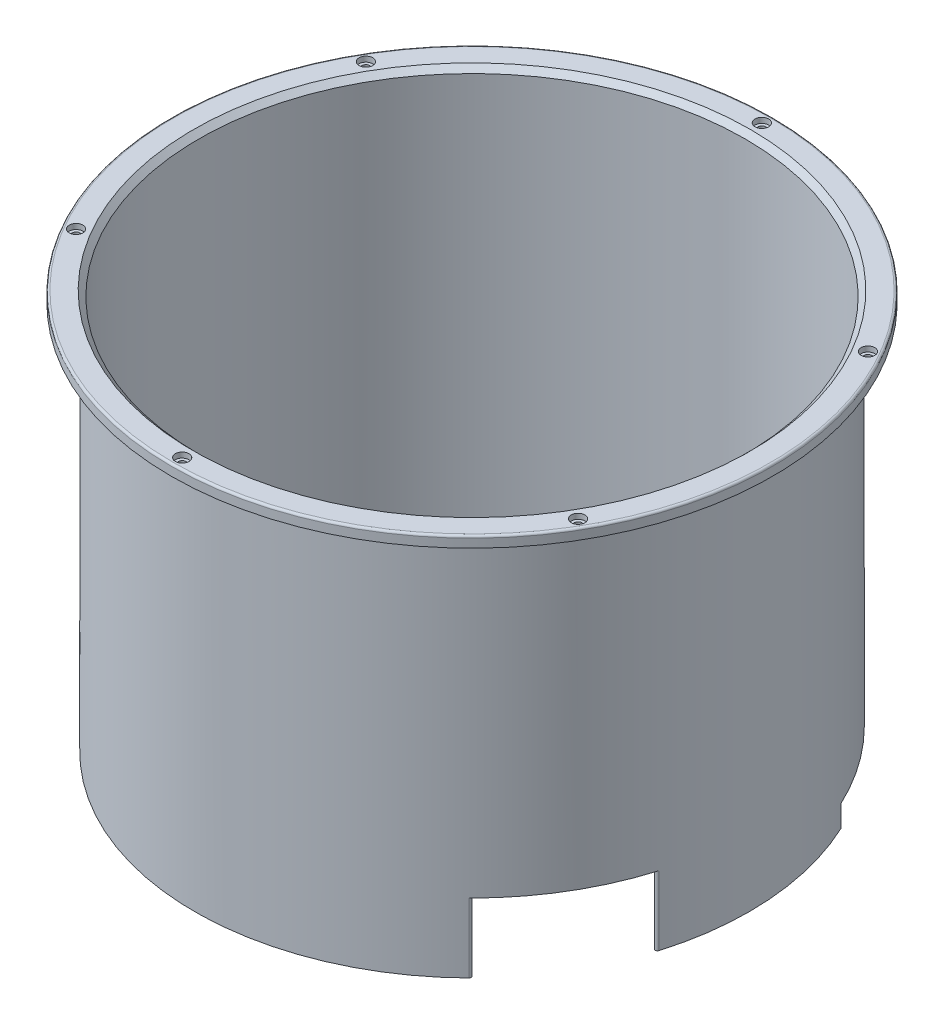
ISO-10303-21;
HEADER;
FILE_DESCRIPTION(('STEP AP214'),'2;1');
FILE_NAME('part.step','',(''),(''),'','','');
FILE_SCHEMA(('AUTOMOTIVE_DESIGN { 1 0 10303 214 1 1 1 1 }'));
ENDSEC;
DATA;
#1=APPLICATION_CONTEXT('core data for automotive mechanical design processes');
#2=APPLICATION_PROTOCOL_DEFINITION('international standard','automotive_design',2000,#1);
#3=PRODUCT_CONTEXT('',#1,'mechanical');
#4=PRODUCT('Part','Part','',(#3));
#5=PRODUCT_RELATED_PRODUCT_CATEGORY('part','',(#4));
#6=PRODUCT_DEFINITION_FORMATION('','',#4);
#7=PRODUCT_DEFINITION_CONTEXT('part definition',#1,'design');
#8=PRODUCT_DEFINITION('design','',#6,#7);
#9=PRODUCT_DEFINITION_SHAPE('','',#8);
#10=(LENGTH_UNIT() NAMED_UNIT(*) SI_UNIT(.MILLI.,.METRE.));
#11=(NAMED_UNIT(*) PLANE_ANGLE_UNIT() SI_UNIT($,.RADIAN.));
#12=(NAMED_UNIT(*) SI_UNIT($,.STERADIAN.) SOLID_ANGLE_UNIT());
#13=UNCERTAINTY_MEASURE_WITH_UNIT(LENGTH_MEASURE(1.E-05),#10,'distance_accuracy_value','');
#14=(GEOMETRIC_REPRESENTATION_CONTEXT(3) GLOBAL_UNCERTAINTY_ASSIGNED_CONTEXT((#13)) GLOBAL_UNIT_ASSIGNED_CONTEXT((#10,
#11,#12)) REPRESENTATION_CONTEXT('',''));
#15=CARTESIAN_POINT('',(0.,0.,0.));
#16=DIRECTION('',(0.,0.,1.));
#17=DIRECTION('',(1.,0.,0.));
#18=AXIS2_PLACEMENT_3D('',#15,#16,#17);
#19=CARTESIAN_POINT('',(156.129948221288,89.4079999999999,46.3952505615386));
#20=CARTESIAN_POINT('',(156.129948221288,86.6986666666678,46.3952505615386));
#21=CARTESIAN_POINT('',(156.129948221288,83.9893333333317,46.3952505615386));
#22=CARTESIAN_POINT('',(156.129948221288,67.7333333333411,46.3952505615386));
#23=CARTESIAN_POINT('',(156.129948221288,54.1866666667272,46.3952505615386));
#24=CARTESIAN_POINT('',(156.129948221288,27.0933333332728,46.3952505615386));
#25=CARTESIAN_POINT('',(156.129948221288,13.5466666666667,46.3952505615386));
#26=CARTESIAN_POINT('',(156.129948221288,-2.70933333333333,46.3952505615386));
#27=CARTESIAN_POINT('',(156.129948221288,-5.41866666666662,46.3952505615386));
#28=CARTESIAN_POINT('',(156.129948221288,-8.12799999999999,46.3952505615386));
#29=CARTESIAN_POINT('',(155.88877732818,89.4079999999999,47.2068422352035));
#30=CARTESIAN_POINT('',(155.88877732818,86.6986666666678,47.2068422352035));
#31=CARTESIAN_POINT('',(155.88877732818,83.9893333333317,47.2068422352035));
#32=CARTESIAN_POINT('',(155.88877732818,67.7333333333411,47.2068422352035));
#33=CARTESIAN_POINT('',(155.88877732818,54.1866666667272,47.2068422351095));
#34=CARTESIAN_POINT('',(155.88877732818,27.0933333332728,47.2068422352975));
#35=CARTESIAN_POINT('',(155.88877732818,13.5466666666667,47.2068422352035));
#36=CARTESIAN_POINT('',(155.88877732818,-2.70933333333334,47.2068422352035));
#37=CARTESIAN_POINT('',(155.88877732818,-5.41866666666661,47.2068422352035));
#38=CARTESIAN_POINT('',(155.88877732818,-8.12799999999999,47.2068422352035));
#39=CARTESIAN_POINT('',(154.978619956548,89.4079999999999,48.0404536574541));
#40=CARTESIAN_POINT('',(154.978619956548,86.6986666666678,48.0404536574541));
#41=CARTESIAN_POINT('',(154.978619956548,83.9893333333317,48.0404536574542));
#42=CARTESIAN_POINT('',(154.978619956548,67.7333333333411,48.0404536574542));
#43=CARTESIAN_POINT('',(154.978619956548,54.1866666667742,48.0404536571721));
#44=CARTESIAN_POINT('',(154.978619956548,27.0933333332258,48.0404536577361));
#45=CARTESIAN_POINT('',(154.978619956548,13.5466666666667,48.0404536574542));
#46=CARTESIAN_POINT('',(154.978619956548,-2.70933333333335,48.0404536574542));
#47=CARTESIAN_POINT('',(154.978619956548,-5.4186666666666,48.0404536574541));
#48=CARTESIAN_POINT('',(154.978619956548,-8.12799999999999,48.0404536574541));
#49=CARTESIAN_POINT('',(153.76123244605,89.4079999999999,47.678697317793));
#50=CARTESIAN_POINT('',(153.76123244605,86.6986666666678,47.678697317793));
#51=CARTESIAN_POINT('',(153.76123244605,83.9893333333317,47.678697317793));
#52=CARTESIAN_POINT('',(153.76123244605,67.7333333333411,47.678697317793));
#53=CARTESIAN_POINT('',(153.761232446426,54.1866666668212,47.678697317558));
#54=CARTESIAN_POINT('',(153.761232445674,27.0933333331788,47.678697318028));
#55=CARTESIAN_POINT('',(153.76123244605,13.5466666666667,47.678697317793));
#56=CARTESIAN_POINT('',(153.76123244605,-2.70933333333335,47.678697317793));
#57=CARTESIAN_POINT('',(153.76123244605,-5.4186666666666,47.678697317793));
#58=CARTESIAN_POINT('',(153.76123244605,-8.12799999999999,47.678697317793));
#59=CARTESIAN_POINT('',(153.454002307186,89.4079999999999,46.4833295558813));
#60=CARTESIAN_POINT('',(153.454002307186,86.6986666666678,46.4833295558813));
#61=CARTESIAN_POINT('',(153.454002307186,83.9893333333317,46.4833295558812));
#62=CARTESIAN_POINT('',(153.454002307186,67.7333333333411,46.4833295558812));
#63=CARTESIAN_POINT('',(153.454002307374,54.1866666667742,46.4833295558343));
#64=CARTESIAN_POINT('',(153.454002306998,27.0933333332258,46.4833295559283));
#65=CARTESIAN_POINT('',(153.454002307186,13.5466666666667,46.4833295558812));
#66=CARTESIAN_POINT('',(153.454002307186,-2.70933333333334,46.4833295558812));
#67=CARTESIAN_POINT('',(153.454002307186,-5.41866666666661,46.4833295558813));
#68=CARTESIAN_POINT('',(153.454002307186,-8.12799999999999,46.4833295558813));
#69=CARTESIAN_POINT('',(153.695173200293,89.4079999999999,45.6717378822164));
#70=CARTESIAN_POINT('',(153.695173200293,86.6986666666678,45.6717378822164));
#71=CARTESIAN_POINT('',(153.695173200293,83.9893333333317,45.6717378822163));
#72=CARTESIAN_POINT('',(153.695173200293,67.7333333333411,45.6717378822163));
#73=CARTESIAN_POINT('',(153.695173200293,54.1866666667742,45.6717378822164));
#74=CARTESIAN_POINT('',(153.695173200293,27.0933333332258,45.6717378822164));
#75=CARTESIAN_POINT('',(153.695173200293,13.5466666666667,45.6717378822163));
#76=CARTESIAN_POINT('',(153.695173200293,-2.70933333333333,45.6717378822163));
#77=CARTESIAN_POINT('',(153.695173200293,-5.41866666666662,45.6717378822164));
#78=CARTESIAN_POINT('',(153.695173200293,-8.12799999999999,45.6717378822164));
#79=(BOUNDED_SURFACE() B_SPLINE_SURFACE(5,3,((#19,#20,#21,#22,#23,#24,#25,#26,#27,#28),(#29,#30,
#31,#32,#33,#34,#35,#36,#37,#38),(#39,#40,#41,#42,#43,#44,#45,#46,#47,#48),(#49,#50,#51,#52,#53,
#54,#55,#56,#57,#58),(#59,#60,#61,#62,#63,#64,#65,#66,#67,#68),(#69,#70,#71,#72,#73,#74,#75,#76,
#77,#78)),.UNSPECIFIED.,.F.,.F.,.F.) B_SPLINE_SURFACE_WITH_KNOTS((6,6),(4,2,2,2,4),(0.,1.),
(-1.2,-1.,0.,1.,1.2),
.UNSPECIFIED.) GEOMETRIC_REPRESENTATION_ITEM() RATIONAL_B_SPLINE_SURFACE(((1.,1.,1.,1.,1.,1.,1.,
1.,1.,1.),(0.600000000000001,0.600000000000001,0.599999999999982,0.599999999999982,
0.599999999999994,0.599999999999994,0.599999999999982,0.599999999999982,0.600000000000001,
0.600000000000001),(0.400000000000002,0.400000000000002,0.399999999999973,0.399999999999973,
0.399999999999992,0.399999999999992,0.399999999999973,0.399999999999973,0.400000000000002,
0.400000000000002),(0.400000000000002,0.400000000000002,0.399999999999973,0.399999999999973,
0.399999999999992,0.399999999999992,0.399999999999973,0.399999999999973,0.400000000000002,
0.400000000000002),(0.600000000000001,0.600000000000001,0.599999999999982,0.599999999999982,
0.599999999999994,0.599999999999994,0.599999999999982,0.599999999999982,0.600000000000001,
0.600000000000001),(1.,1.,1.,1.,1.,1.,1.,1.,1.,1.))) REPRESENTATION_ITEM('') SURFACE());
#80=CARTESIAN_POINT('',(156.129948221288,-8.12799999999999,46.3952505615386));
#81=CARTESIAN_POINT('',(156.129948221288,-5.41866666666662,46.3952505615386));
#82=CARTESIAN_POINT('',(156.129948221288,-2.70933333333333,46.3952505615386));
#83=CARTESIAN_POINT('',(156.129948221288,13.5466666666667,46.3952505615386));
#84=CARTESIAN_POINT('',(156.129948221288,27.0933333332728,46.3952505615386));
#85=CARTESIAN_POINT('',(156.129948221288,54.1866666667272,46.3952505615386));
#86=CARTESIAN_POINT('',(156.129948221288,67.7333333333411,46.3952505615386));
#87=CARTESIAN_POINT('',(156.129948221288,83.9893333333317,46.3952505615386));
#88=CARTESIAN_POINT('',(156.129948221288,86.6986666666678,46.3952505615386));
#89=CARTESIAN_POINT('',(156.129948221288,89.4079999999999,46.3952505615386));
#90=(BOUNDED_CURVE() B_SPLINE_CURVE(3,(#80,#81,#82,#83,#84,#85,#86,#87,#88,#89),.UNSPECIFIED.,
.F.,.F.) B_SPLINE_CURVE_WITH_KNOTS((4,2,2,2,4),(-1.2,-1.,0.,1.,1.2),
.UNSPECIFIED.) CURVE() GEOMETRIC_REPRESENTATION_ITEM() RATIONAL_B_SPLINE_CURVE((1.,1.,1.,1.,1.,
1.,1.,1.,1.,1.)) REPRESENTATION_ITEM(''));
#91=CARTESIAN_POINT('',(156.129948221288,40.64,46.3952505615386));
#92=VERTEX_POINT('',#91);
#93=CARTESIAN_POINT('',(156.129948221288,0.,46.3952505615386));
#94=VERTEX_POINT('',#93);
#95=EDGE_CURVE('E139',#92,#94,#90,.F.);
#96=CARTESIAN_POINT('',(156.129948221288,40.64,46.3952505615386));
#97=CARTESIAN_POINT('',(155.888777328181,40.64,47.2068422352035));
#98=CARTESIAN_POINT('',(154.978619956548,40.64,48.0404536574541));
#99=CARTESIAN_POINT('',(153.76123244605,40.64,47.678697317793));
#100=CARTESIAN_POINT('',(153.454002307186,40.64,46.4833295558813));
#101=CARTESIAN_POINT('',(153.695173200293,40.64,45.6717378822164));
#102=(BOUNDED_CURVE() B_SPLINE_CURVE(5,(#96,#97,#98,#99,#100,#101),.UNSPECIFIED.,.F.,
.F.) B_SPLINE_CURVE_WITH_KNOTS((6,6),(0.,1.),
.UNSPECIFIED.) CURVE() GEOMETRIC_REPRESENTATION_ITEM() RATIONAL_B_SPLINE_CURVE((1.,
0.599999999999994,0.399999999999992,0.399999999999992,0.599999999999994,1.)) REPRESENTATION_ITEM(''));
#103=CARTESIAN_POINT('',(153.695173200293,40.64,45.6717378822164));
#104=VERTEX_POINT('',#103);
#105=EDGE_CURVE('E11',#104,#92,#102,.F.);
#106=CARTESIAN_POINT('',(153.695173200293,89.4079999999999,45.6717378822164));
#107=CARTESIAN_POINT('',(153.695173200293,86.6986666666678,45.6717378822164));
#108=CARTESIAN_POINT('',(153.695173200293,83.9893333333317,45.6717378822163));
#109=CARTESIAN_POINT('',(153.695173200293,67.7333333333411,45.6717378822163));
#110=CARTESIAN_POINT('',(153.695173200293,54.1866666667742,45.6717378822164));
#111=CARTESIAN_POINT('',(153.695173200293,27.0933333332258,45.6717378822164));
#112=CARTESIAN_POINT('',(153.695173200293,13.5466666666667,45.6717378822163));
#113=CARTESIAN_POINT('',(153.695173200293,-2.70933333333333,45.6717378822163));
#114=CARTESIAN_POINT('',(153.695173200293,-5.41866666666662,45.6717378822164));
#115=CARTESIAN_POINT('',(153.695173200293,-8.12799999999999,45.6717378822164));
#116=(BOUNDED_CURVE() B_SPLINE_CURVE(3,(#106,#107,#108,#109,#110,#111,#112,#113,#114,#115),
.UNSPECIFIED.,.F.,.F.) B_SPLINE_CURVE_WITH_KNOTS((4,2,2,2,4),(-1.2,-1.,0.,1.,1.2),
.UNSPECIFIED.) CURVE() GEOMETRIC_REPRESENTATION_ITEM() RATIONAL_B_SPLINE_CURVE((1.,1.,1.,1.,1.,
1.,1.,1.,1.,1.)) REPRESENTATION_ITEM(''));
#117=CARTESIAN_POINT('',(153.695173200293,0.,45.6717378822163));
#118=VERTEX_POINT('',#117);
#119=EDGE_CURVE('E274',#118,#104,#116,.F.);
#120=CARTESIAN_POINT('',(153.695173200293,0.,45.6717378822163));
#121=CARTESIAN_POINT('',(153.454002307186,0.,46.4833295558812));
#122=CARTESIAN_POINT('',(153.76123244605,0.,47.678697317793));
#123=CARTESIAN_POINT('',(154.978619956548,0.,48.0404536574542));
#124=CARTESIAN_POINT('',(155.88877732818,0.,47.2068422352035));
#125=CARTESIAN_POINT('',(156.129948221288,0.,46.3952505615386));
#126=(BOUNDED_CURVE() B_SPLINE_CURVE(5,(#120,#121,#122,#123,#124,#125),.UNSPECIFIED.,.F.,
.F.) B_SPLINE_CURVE_WITH_KNOTS((6,6),(0.,1.),
.UNSPECIFIED.) CURVE() GEOMETRIC_REPRESENTATION_ITEM() RATIONAL_B_SPLINE_CURVE((1.,
0.599999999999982,0.399999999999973,0.399999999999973,0.599999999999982,1.)) REPRESENTATION_ITEM(''));
#127=EDGE_CURVE('E61',#94,#118,#126,.F.);
#128=ORIENTED_EDGE('',*,*,#95,.F.);
#129=ORIENTED_EDGE('',*,*,#105,.F.);
#130=ORIENTED_EDGE('',*,*,#119,.F.);
#131=ORIENTED_EDGE('',*,*,#127,.F.);
#132=EDGE_LOOP('',(#128,#129,#130,#131));
#133=FACE_BOUND('',#132,.T.);
#134=ADVANCED_FACE('F47',(#133),#79,.T.);
#135=CARTESIAN_POINT('',(112.481264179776,89.4079999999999,114.263201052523));
#136=CARTESIAN_POINT('',(112.481264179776,86.6986666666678,114.263201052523));
#137=CARTESIAN_POINT('',(112.481264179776,83.9893333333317,114.263201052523));
#138=CARTESIAN_POINT('',(112.481264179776,67.7333333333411,114.263201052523));
#139=CARTESIAN_POINT('',(112.481264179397,54.1866666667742,114.263201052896));
#140=CARTESIAN_POINT('',(112.481264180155,27.0933333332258,114.26320105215));
#141=CARTESIAN_POINT('',(112.481264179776,13.5466666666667,114.263201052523));
#142=CARTESIAN_POINT('',(112.481264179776,-2.70933333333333,114.263201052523));
#143=CARTESIAN_POINT('',(112.481264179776,-5.41866666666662,114.263201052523));
#144=CARTESIAN_POINT('',(112.481264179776,-8.12799999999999,114.263201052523));
#145=CARTESIAN_POINT('',(113.084634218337,89.4079999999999,113.669240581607));
#146=CARTESIAN_POINT('',(113.084634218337,86.6986666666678,113.669240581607));
#147=CARTESIAN_POINT('',(113.084634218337,83.9893333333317,113.669240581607));
#148=CARTESIAN_POINT('',(113.084634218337,67.7333333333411,113.669240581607));
#149=CARTESIAN_POINT('',(113.084634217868,54.1866666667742,113.669240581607));
#150=CARTESIAN_POINT('',(113.084634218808,27.0933333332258,113.669240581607));
#151=CARTESIAN_POINT('',(113.084634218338,13.5466666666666,113.669240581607));
#152=CARTESIAN_POINT('',(113.084634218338,-2.70933333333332,113.669240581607));
#153=CARTESIAN_POINT('',(113.084634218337,-5.41866666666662,113.669240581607));
#154=CARTESIAN_POINT('',(113.084634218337,-8.12799999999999,113.669240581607));
#155=CARTESIAN_POINT('',(114.284317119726,89.4079999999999,113.379317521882));
#156=CARTESIAN_POINT('',(114.284317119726,86.6986666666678,113.379317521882));
#157=CARTESIAN_POINT('',(114.284317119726,83.9893333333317,113.379317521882));
#158=CARTESIAN_POINT('',(114.284317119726,67.7333333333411,113.379317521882));
#159=CARTESIAN_POINT('',(114.28431711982,54.1866666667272,113.379317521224));
#160=CARTESIAN_POINT('',(114.284317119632,27.0933333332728,113.37931752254));
#161=CARTESIAN_POINT('',(114.284317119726,13.5466666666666,113.379317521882));
#162=CARTESIAN_POINT('',(114.284317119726,-2.70933333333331,113.379317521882));
#163=CARTESIAN_POINT('',(114.284317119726,-5.41866666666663,113.379317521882));
#164=CARTESIAN_POINT('',(114.284317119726,-8.12799999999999,113.379317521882));
#165=CARTESIAN_POINT('',(115.175257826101,89.4079999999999,114.284372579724));
#166=CARTESIAN_POINT('',(115.175257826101,86.6986666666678,114.284372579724));
#167=CARTESIAN_POINT('',(115.175257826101,83.9893333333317,114.284372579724));
#168=CARTESIAN_POINT('',(115.175257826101,67.7333333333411,114.284372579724));
#169=CARTESIAN_POINT('',(115.175257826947,54.1866666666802,114.284372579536));
#170=CARTESIAN_POINT('',(115.175257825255,27.0933333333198,114.284372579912));
#171=CARTESIAN_POINT('',(115.175257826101,13.5466666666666,114.284372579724));
#172=CARTESIAN_POINT('',(115.175257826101,-2.70933333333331,114.284372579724));
#173=CARTESIAN_POINT('',(115.175257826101,-5.41866666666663,114.284372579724));
#174=CARTESIAN_POINT('',(115.175257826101,-8.12799999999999,114.284372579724));
#175=CARTESIAN_POINT('',(114.866515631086,89.4079999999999,115.479350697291));
#176=CARTESIAN_POINT('',(114.866515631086,86.6986666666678,115.479350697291));
#177=CARTESIAN_POINT('',(114.866515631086,83.9893333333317,115.479350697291));
#178=CARTESIAN_POINT('',(114.866515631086,67.7333333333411,115.479350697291));
#179=CARTESIAN_POINT('',(114.866515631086,54.1866666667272,115.479350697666));
#180=CARTESIAN_POINT('',(114.866515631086,27.0933333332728,115.479350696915));
#181=CARTESIAN_POINT('',(114.866515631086,13.5466666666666,115.479350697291));
#182=CARTESIAN_POINT('',(114.866515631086,-2.70933333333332,115.479350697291));
#183=CARTESIAN_POINT('',(114.866515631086,-5.41866666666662,115.479350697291));
#184=CARTESIAN_POINT('',(114.866515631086,-8.12799999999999,115.479350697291));
#185=CARTESIAN_POINT('',(114.263145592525,89.4079999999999,116.073311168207));
#186=CARTESIAN_POINT('',(114.263145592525,86.6986666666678,116.073311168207));
#187=CARTESIAN_POINT('',(114.263145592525,83.9893333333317,116.073311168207));
#188=CARTESIAN_POINT('',(114.263145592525,67.7333333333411,116.073311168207));
#189=CARTESIAN_POINT('',(114.263145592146,54.1866666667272,116.07331116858));
#190=CARTESIAN_POINT('',(114.263145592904,27.0933333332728,116.073311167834));
#191=CARTESIAN_POINT('',(114.263145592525,13.5466666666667,116.073311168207));
#192=CARTESIAN_POINT('',(114.263145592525,-2.70933333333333,116.073311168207));
#193=CARTESIAN_POINT('',(114.263145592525,-5.41866666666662,116.073311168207));
#194=CARTESIAN_POINT('',(114.263145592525,-8.12799999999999,116.073311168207));
#195=(BOUNDED_SURFACE() B_SPLINE_SURFACE(5,3,((#135,#136,#137,#138,#139,#140,#141,#142,#143,
#144),(#145,#146,#147,#148,#149,#150,#151,#152,#153,#154),(#155,#156,#157,#158,#159,#160,#161,
#162,#163,#164),(#165,#166,#167,#168,#169,#170,#171,#172,#173,#174),(#175,#176,#177,#178,#179,
#180,#181,#182,#183,#184),(#185,#186,#187,#188,#189,#190,#191,#192,#193,#194)),.UNSPECIFIED.,
.F.,.F.,.F.) B_SPLINE_SURFACE_WITH_KNOTS((6,6),(4,2,2,2,4),(0.,1.),(-1.2,-1.,0.,1.,1.2),
.UNSPECIFIED.) GEOMETRIC_REPRESENTATION_ITEM() RATIONAL_B_SPLINE_SURFACE(((1.,1.,1.,1.,1.,1.,1.,
1.,1.,1.),(0.59999999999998,0.59999999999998,0.59999999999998,0.59999999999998,
0.600000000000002,0.600000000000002,0.599999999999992,0.599999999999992,0.59999999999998,
0.59999999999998),(0.39999999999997,0.39999999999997,0.39999999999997,0.39999999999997,
0.400000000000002,0.400000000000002,0.399999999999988,0.399999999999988,0.39999999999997,
0.39999999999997),(0.39999999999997,0.39999999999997,0.39999999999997,0.39999999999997,
0.400000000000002,0.400000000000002,0.399999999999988,0.399999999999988,0.39999999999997,
0.39999999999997),(0.59999999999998,0.59999999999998,0.59999999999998,0.59999999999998,
0.600000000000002,0.600000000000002,0.599999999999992,0.599999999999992,0.59999999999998,
0.59999999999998),(1.,1.,1.,1.,1.,1.,1.,1.,1.,1.))) REPRESENTATION_ITEM('') SURFACE());
#196=CARTESIAN_POINT('',(114.263145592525,89.4079999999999,116.073311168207));
#197=CARTESIAN_POINT('',(114.263145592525,86.6986666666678,116.073311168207));
#198=CARTESIAN_POINT('',(114.263145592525,83.9893333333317,116.073311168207));
#199=CARTESIAN_POINT('',(114.263145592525,67.7333333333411,116.073311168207));
#200=CARTESIAN_POINT('',(114.263145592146,54.1866666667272,116.07331116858));
#201=CARTESIAN_POINT('',(114.263145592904,27.0933333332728,116.073311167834));
#202=CARTESIAN_POINT('',(114.263145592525,13.5466666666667,116.073311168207));
#203=CARTESIAN_POINT('',(114.263145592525,-2.70933333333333,116.073311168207));
#204=CARTESIAN_POINT('',(114.263145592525,-5.41866666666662,116.073311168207));
#205=CARTESIAN_POINT('',(114.263145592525,-8.12799999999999,116.073311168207));
#206=(BOUNDED_CURVE() B_SPLINE_CURVE(3,(#196,#197,#198,#199,#200,#201,#202,#203,#204,#205),
.UNSPECIFIED.,.F.,.F.) B_SPLINE_CURVE_WITH_KNOTS((4,2,2,2,4),(-1.2,-1.,0.,1.,1.2),
.UNSPECIFIED.) CURVE() GEOMETRIC_REPRESENTATION_ITEM() RATIONAL_B_SPLINE_CURVE((1.,1.,1.,1.,1.,
1.,1.,1.,1.,1.)) REPRESENTATION_ITEM(''));
#207=CARTESIAN_POINT('',(114.263145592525,0.,116.073311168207));
#208=VERTEX_POINT('',#207);
#209=CARTESIAN_POINT('',(114.263145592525,40.64,116.073311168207));
#210=VERTEX_POINT('',#209);
#211=EDGE_CURVE('E173',#208,#210,#206,.F.);
#212=CARTESIAN_POINT('',(114.263145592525,0.,116.073311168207));
#213=CARTESIAN_POINT('',(114.866515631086,0.,115.479350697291));
#214=CARTESIAN_POINT('',(115.175257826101,0.,114.284372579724));
#215=CARTESIAN_POINT('',(114.284317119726,0.,113.379317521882));
#216=CARTESIAN_POINT('',(113.084634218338,0.,113.669240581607));
#217=CARTESIAN_POINT('',(112.481264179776,0.,114.263201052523));
#218=(BOUNDED_CURVE() B_SPLINE_CURVE(5,(#212,#213,#214,#215,#216,#217),.UNSPECIFIED.,.F.,
.F.) B_SPLINE_CURVE_WITH_KNOTS((6,6),(0.,1.),
.UNSPECIFIED.) CURVE() GEOMETRIC_REPRESENTATION_ITEM() RATIONAL_B_SPLINE_CURVE((1.,
0.599999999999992,0.399999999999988,0.399999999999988,0.599999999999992,1.)) REPRESENTATION_ITEM(''));
#219=CARTESIAN_POINT('',(112.481264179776,0.,114.263201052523));
#220=VERTEX_POINT('',#219);
#221=EDGE_CURVE('E360',#220,#208,#218,.F.);
#222=CARTESIAN_POINT('',(112.481264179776,-8.12799999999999,114.263201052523));
#223=CARTESIAN_POINT('',(112.481264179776,-5.41866666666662,114.263201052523));
#224=CARTESIAN_POINT('',(112.481264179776,-2.70933333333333,114.263201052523));
#225=CARTESIAN_POINT('',(112.481264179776,13.5466666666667,114.263201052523));
#226=CARTESIAN_POINT('',(112.481264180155,27.0933333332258,114.26320105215));
#227=CARTESIAN_POINT('',(112.481264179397,54.1866666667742,114.263201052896));
#228=CARTESIAN_POINT('',(112.481264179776,67.7333333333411,114.263201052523));
#229=CARTESIAN_POINT('',(112.481264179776,83.9893333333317,114.263201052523));
#230=CARTESIAN_POINT('',(112.481264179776,86.6986666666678,114.263201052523));
#231=CARTESIAN_POINT('',(112.481264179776,89.4079999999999,114.263201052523));
#232=(BOUNDED_CURVE() B_SPLINE_CURVE(3,(#222,#223,#224,#225,#226,#227,#228,#229,#230,#231),
.UNSPECIFIED.,.F.,.F.) B_SPLINE_CURVE_WITH_KNOTS((4,2,2,2,4),(-1.2,-1.,0.,1.,1.2),
.UNSPECIFIED.) CURVE() GEOMETRIC_REPRESENTATION_ITEM() RATIONAL_B_SPLINE_CURVE((1.,1.,1.,1.,1.,
1.,1.,1.,1.,1.)) REPRESENTATION_ITEM(''));
#233=CARTESIAN_POINT('',(112.481264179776,40.64,114.263201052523));
#234=VERTEX_POINT('',#233);
#235=EDGE_CURVE('E225',#234,#220,#232,.F.);
#236=CARTESIAN_POINT('',(112.481264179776,40.64,114.263201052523));
#237=CARTESIAN_POINT('',(113.084634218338,40.64,113.669240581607));
#238=CARTESIAN_POINT('',(114.284317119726,40.64,113.379317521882));
#239=CARTESIAN_POINT('',(115.175257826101,40.64,114.284372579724));
#240=CARTESIAN_POINT('',(114.866515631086,40.64,115.47935069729));
#241=CARTESIAN_POINT('',(114.263145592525,40.64,116.073311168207));
#242=(BOUNDED_CURVE() B_SPLINE_CURVE(5,(#236,#237,#238,#239,#240,#241),.UNSPECIFIED.,.F.,
.F.) B_SPLINE_CURVE_WITH_KNOTS((6,6),(0.,1.),
.UNSPECIFIED.) CURVE() GEOMETRIC_REPRESENTATION_ITEM() RATIONAL_B_SPLINE_CURVE((1.,
0.600000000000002,0.400000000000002,0.400000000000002,0.600000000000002,1.)) REPRESENTATION_ITEM(''));
#243=EDGE_CURVE('E319',#210,#234,#242,.F.);
#244=ORIENTED_EDGE('',*,*,#211,.F.);
#245=ORIENTED_EDGE('',*,*,#221,.F.);
#246=ORIENTED_EDGE('',*,*,#235,.F.);
#247=ORIENTED_EDGE('',*,*,#243,.F.);
#248=EDGE_LOOP('',(#244,#245,#246,#247));
#249=FACE_BOUND('',#248,.T.);
#250=ADVANCED_FACE('F325',(#249),#195,.T.);
#251=CARTESIAN_POINT('',(-162.8775,0.,0.));
#252=DIRECTION('',(0.,1.,0.));
#253=DIRECTION('',(0.,0.,1.));
#254=AXIS2_PLACEMENT_3D('',#251,#252,#253);
#255=PLANE('',#254);
#256=CARTESIAN_POINT('',(0.,0.,0.));
#257=DIRECTION('',(0.,-1.,0.));
#258=DIRECTION('',(0.,0.,-1.));
#259=AXIS2_PLACEMENT_3D('',#256,#257,#258);
#260=CIRCLE('',#259,162.8775);
#261=CARTESIAN_POINT('',(147.433743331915,0.,-69.2269552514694));
#262=VERTEX_POINT('',#261);
#263=EDGE_CURVE('E119',#262,#94,#260,.T.);
#264=ORIENTED_EDGE('',*,*,#263,.T.);
#265=ORIENTED_EDGE('',*,*,#127,.T.);
#266=CARTESIAN_POINT('',(0.,0.,0.));
#267=DIRECTION('',(0.,-1.,0.));
#268=DIRECTION('',(0.,0.,-1.));
#269=AXIS2_PLACEMENT_3D('',#266,#267,#268);
#270=CIRCLE('',#269,160.3375);
#271=CARTESIAN_POINT('',(145.134581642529,0.,-68.1473925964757));
#272=VERTEX_POINT('',#271);
#273=EDGE_CURVE('E121',#272,#118,#270,.T.);
#274=ORIENTED_EDGE('',*,*,#273,.F.);
#275=CARTESIAN_POINT('',(146.284162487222,0.,-68.6871739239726));
#276=DIRECTION('',(0.,1.,0.));
#277=DIRECTION('',(0.,0.,1.));
#278=AXIS2_PLACEMENT_3D('',#275,#276,#277);
#279=CIRCLE('',#278,1.27);
#280=EDGE_CURVE('E116',#272,#262,#279,.F.);
#281=ORIENTED_EDGE('',*,*,#280,.T.);
#282=EDGE_LOOP('',(#264,#265,#274,#281));
#283=FACE_BOUND('',#282,.T.);
#284=ADVANCED_FACE('F118',(#283),#255,.F.);
#285=CARTESIAN_POINT('',(0.,0.,0.));
#286=DIRECTION('',(0.,-1.,0.));
#287=DIRECTION('',(0.,0.,-1.));
#288=AXIS2_PLACEMENT_3D('',#285,#286,#287);
#289=CYLINDRICAL_SURFACE('',#288,162.8775);
#290=CARTESIAN_POINT('',(0.,40.64,0.));
#291=DIRECTION('',(0.,1.,0.));
#292=DIRECTION('',(0.,0.,1.));
#293=AXIS2_PLACEMENT_3D('',#290,#291,#292);
#294=CIRCLE('',#293,162.8775);
#295=EDGE_CURVE('E373',#210,#92,#294,.T.);
#296=ORIENTED_EDGE('',*,*,#295,.T.);
#297=ORIENTED_EDGE('',*,*,#95,.T.);
#298=ORIENTED_EDGE('',*,*,#263,.F.);
#299=DIRECTION('',(0.,-1.,0.));
#300=VECTOR('',#299,1.);
#301=CARTESIAN_POINT('',(147.433743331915,0.,-69.2269552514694));
#302=LINE('',#301,#300);
#303=CARTESIAN_POINT('',(147.433743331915,12.7,-69.2269552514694));
#304=VERTEX_POINT('',#303);
#305=EDGE_CURVE('E136',#262,#304,#302,.F.);
#306=ORIENTED_EDGE('',*,*,#305,.T.);
#307=CARTESIAN_POINT('',(0.,12.7,0.));
#308=DIRECTION('',(0.,-1.,0.));
#309=DIRECTION('',(0.,0.,-1.));
#310=AXIS2_PLACEMENT_3D('',#307,#308,#309);
#311=CIRCLE('',#310,162.8775);
#312=CARTESIAN_POINT('',(69.2269552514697,12.7,-147.433743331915));
#313=VERTEX_POINT('',#312);
#314=EDGE_CURVE('E376',#313,#304,#311,.T.);
#315=ORIENTED_EDGE('',*,*,#314,.F.);
#316=DIRECTION('',(0.,-1.,0.));
#317=VECTOR('',#316,1.);
#318=CARTESIAN_POINT('',(69.2269552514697,0.,-147.433743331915));
#319=LINE('',#318,#317);
#320=CARTESIAN_POINT('',(69.2269552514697,0.,-147.433743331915));
#321=VERTEX_POINT('',#320);
#322=EDGE_CURVE('E149',#313,#321,#319,.T.);
#323=ORIENTED_EDGE('',*,*,#322,.T.);
#324=EDGE_CURVE('E142',#208,#321,#260,.T.);
#325=ORIENTED_EDGE('',*,*,#324,.F.);
#326=ORIENTED_EDGE('',*,*,#211,.T.);
#327=EDGE_LOOP('',(#296,#297,#298,#306,#315,#323,#325,#326));
#328=FACE_BOUND('',#327,.T.);
#329=CARTESIAN_POINT('',(0.,226.9236,0.));
#330=DIRECTION('',(0.,1.,0.));
#331=DIRECTION('',(0.,0.,1.));
#332=AXIS2_PLACEMENT_3D('',#329,#330,#331);
#333=CIRCLE('',#332,162.8775);
#334=CARTESIAN_POINT('',(0.,226.9236,162.8775));
#335=VERTEX_POINT('',#334);
#336=EDGE_CURVE('E495',#335,#335,#333,.F.);
#337=ORIENTED_EDGE('',*,*,#336,.T.);
#338=EDGE_LOOP('',(#337));
#339=FACE_BOUND('',#338,.T.);
#340=ADVANCED_FACE('F133',(#328,#339),#289,.T.);
#341=CARTESIAN_POINT('',(68.147392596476,0.,-145.134581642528));
#342=VERTEX_POINT('',#341);
#343=EDGE_CURVE('E143',#220,#342,#270,.T.);
#344=ORIENTED_EDGE('',*,*,#343,.F.);
#345=ORIENTED_EDGE('',*,*,#221,.T.);
#346=ORIENTED_EDGE('',*,*,#324,.T.);
#347=CARTESIAN_POINT('',(68.6871739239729,0.,-146.284162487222));
#348=DIRECTION('',(0.,1.,0.));
#349=DIRECTION('',(0.,0.,1.));
#350=AXIS2_PLACEMENT_3D('',#347,#348,#349);
#351=CIRCLE('',#350,1.27);
#352=EDGE_CURVE('E127',#321,#342,#351,.F.);
#353=ORIENTED_EDGE('',*,*,#352,.T.);
#354=EDGE_LOOP('',(#344,#345,#346,#353));
#355=FACE_BOUND('',#354,.T.);
#356=ADVANCED_FACE('F205',(#355),#255,.F.);
#357=CARTESIAN_POINT('',(0.,0.,0.));
#358=DIRECTION('',(0.,-1.,0.));
#359=DIRECTION('',(0.,0.,-1.));
#360=AXIS2_PLACEMENT_3D('',#357,#358,#359);
#361=CYLINDRICAL_SURFACE('',#360,160.3375);
#362=CARTESIAN_POINT('',(0.,231.3686,0.));
#363=DIRECTION('',(0.,-1.,0.));
#364=DIRECTION('',(0.,0.,-1.));
#365=AXIS2_PLACEMENT_3D('',#362,#363,#364);
#366=CIRCLE('',#365,160.3375);
#367=CARTESIAN_POINT('',(0.,231.3686,-160.3375));
#368=VERTEX_POINT('',#367);
#369=EDGE_CURVE('E491',#368,#368,#366,.F.);
#370=ORIENTED_EDGE('',*,*,#369,.T.);
#371=EDGE_LOOP('',(#370));
#372=FACE_BOUND('',#371,.T.);
#373=ORIENTED_EDGE('',*,*,#273,.T.);
#374=ORIENTED_EDGE('',*,*,#119,.T.);
#375=CARTESIAN_POINT('',(0.,40.64,0.));
#376=DIRECTION('',(0.,1.,0.));
#377=DIRECTION('',(0.,0.,1.));
#378=AXIS2_PLACEMENT_3D('',#375,#376,#377);
#379=CIRCLE('',#378,160.3375);
#380=EDGE_CURVE('E67',#104,#234,#379,.F.);
#381=ORIENTED_EDGE('',*,*,#380,.T.);
#382=ORIENTED_EDGE('',*,*,#235,.T.);
#383=ORIENTED_EDGE('',*,*,#343,.T.);
#384=DIRECTION('',(0.,-1.,0.));
#385=VECTOR('',#384,1.);
#386=CARTESIAN_POINT('',(68.1473925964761,0.,-145.134581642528));
#387=LINE('',#386,#385);
#388=CARTESIAN_POINT('',(68.147392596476,12.7,-145.134581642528));
#389=VERTEX_POINT('',#388);
#390=EDGE_CURVE('E155',#342,#389,#387,.F.);
#391=ORIENTED_EDGE('',*,*,#390,.T.);
#392=CARTESIAN_POINT('',(0.,12.7,0.));
#393=DIRECTION('',(0.,-1.,0.));
#394=DIRECTION('',(0.,0.,-1.));
#395=AXIS2_PLACEMENT_3D('',#392,#393,#394);
#396=CIRCLE('',#395,160.3375);
#397=CARTESIAN_POINT('',(145.134581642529,12.7,-68.1473925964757));
#398=VERTEX_POINT('',#397);
#399=EDGE_CURVE('E150',#398,#389,#396,.F.);
#400=ORIENTED_EDGE('',*,*,#399,.F.);
#401=DIRECTION('',(0.,-1.,0.));
#402=VECTOR('',#401,1.);
#403=CARTESIAN_POINT('',(145.134581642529,0.,-68.1473925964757));
#404=LINE('',#403,#402);
#405=EDGE_CURVE('E128',#398,#272,#404,.T.);
#406=ORIENTED_EDGE('',*,*,#405,.T.);
#407=EDGE_LOOP('',(#373,#374,#381,#382,#383,#391,#400,#406));
#408=FACE_BOUND('',#407,.T.);
#409=ADVANCED_FACE('F231',(#372,#408),#361,.F.);
#410=CARTESIAN_POINT('',(-160.3375,234.5436,0.));
#411=DIRECTION('',(0.,-1.,0.));
#412=DIRECTION('',(0.,0.,-1.));
#413=AXIS2_PLACEMENT_3D('',#410,#411,#412);
#414=PLANE('',#413);
#415=CARTESIAN_POINT('',(0.,234.5436,0.));
#416=DIRECTION('',(0.,-1.,0.));
#417=DIRECTION('',(0.,0.,-1.));
#418=AXIS2_PLACEMENT_3D('',#415,#416,#417);
#419=CIRCLE('',#418,163.5125);
#420=CARTESIAN_POINT('',(0.,234.5436,-163.5125));
#421=VERTEX_POINT('',#420);
#422=EDGE_CURVE('E487',#421,#421,#419,.T.);
#423=ORIENTED_EDGE('',*,*,#422,.T.);
#424=EDGE_LOOP('',(#423));
#425=FACE_BOUND('',#424,.T.);
#426=CARTESIAN_POINT('',(0.,234.5436,0.));
#427=DIRECTION('',(0.,-1.,0.));
#428=DIRECTION('',(0.,0.,-1.));
#429=AXIS2_PLACEMENT_3D('',#426,#427,#428);
#430=CIRCLE('',#429,175.26);
#431=CARTESIAN_POINT('',(0.,234.5436,-175.26));
#432=VERTEX_POINT('',#431);
#433=EDGE_CURVE('E483',#432,#432,#430,.F.);
#434=ORIENTED_EDGE('',*,*,#433,.T.);
#435=EDGE_LOOP('',(#434));
#436=FACE_BOUND('',#435,.T.);
#437=CARTESIAN_POINT('',(-147.380203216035,234.5436,-85.0900000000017));
#438=DIRECTION('',(0.,1.,0.));
#439=DIRECTION('',(0.,0.,1.));
#440=AXIS2_PLACEMENT_3D('',#437,#438,#439);
#441=CIRCLE('',#440,4.);
#442=CARTESIAN_POINT('',(-147.380203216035,234.5436,-81.0900000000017));
#443=VERTEX_POINT('',#442);
#444=EDGE_CURVE('E375',#443,#443,#441,.T.);
#445=ORIENTED_EDGE('',*,*,#444,.F.);
#446=EDGE_LOOP('',(#445));
#447=FACE_BOUND('',#446,.T.);
#448=CARTESIAN_POINT('',(-147.380203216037,234.5436,85.0899999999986));
#449=DIRECTION('',(0.,1.,0.));
#450=DIRECTION('',(0.,0.,1.));
#451=AXIS2_PLACEMENT_3D('',#448,#449,#450);
#452=CIRCLE('',#451,4.);
#453=CARTESIAN_POINT('',(-147.380203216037,234.5436,89.0899999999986));
#454=VERTEX_POINT('',#453);
#455=EDGE_CURVE('E393',#454,#454,#452,.T.);
#456=ORIENTED_EDGE('',*,*,#455,.F.);
#457=EDGE_LOOP('',(#456));
#458=FACE_BOUND('',#457,.T.);
#459=CARTESIAN_POINT('',(0.,234.5436,170.18));
#460=DIRECTION('',(0.,1.,0.));
#461=DIRECTION('',(0.,0.,1.));
#462=AXIS2_PLACEMENT_3D('',#459,#460,#461);
#463=CIRCLE('',#462,4.);
#464=CARTESIAN_POINT('',(0.,234.5436,174.18));
#465=VERTEX_POINT('',#464);
#466=EDGE_CURVE('E406',#465,#465,#463,.T.);
#467=ORIENTED_EDGE('',*,*,#466,.F.);
#468=EDGE_LOOP('',(#467));
#469=FACE_BOUND('',#468,.T.);
#470=CARTESIAN_POINT('',(147.380203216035,234.5436,85.0900000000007));
#471=DIRECTION('',(0.,1.,0.));
#472=DIRECTION('',(0.,0.,1.));
#473=AXIS2_PLACEMENT_3D('',#470,#471,#472);
#474=CIRCLE('',#473,4.);
#475=CARTESIAN_POINT('',(147.380203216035,234.5436,89.0900000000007));
#476=VERTEX_POINT('',#475);
#477=EDGE_CURVE('E419',#476,#476,#474,.T.);
#478=ORIENTED_EDGE('',*,*,#477,.F.);
#479=EDGE_LOOP('',(#478));
#480=FACE_BOUND('',#479,.T.);
#481=CARTESIAN_POINT('',(147.380203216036,234.5436,-85.0899999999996));
#482=DIRECTION('',(0.,1.,0.));
#483=DIRECTION('',(0.,0.,1.));
#484=AXIS2_PLACEMENT_3D('',#481,#482,#483);
#485=CIRCLE('',#484,4.);
#486=CARTESIAN_POINT('',(147.380203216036,234.5436,-81.0899999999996));
#487=VERTEX_POINT('',#486);
#488=EDGE_CURVE('E432',#487,#487,#485,.T.);
#489=ORIENTED_EDGE('',*,*,#488,.F.);
#490=EDGE_LOOP('',(#489));
#491=FACE_BOUND('',#490,.T.);
#492=CARTESIAN_POINT('',(0.,234.5436,-170.18));
#493=DIRECTION('',(0.,1.,0.));
#494=DIRECTION('',(0.,0.,1.));
#495=AXIS2_PLACEMENT_3D('',#492,#493,#494);
#496=CIRCLE('',#495,4.);
#497=CARTESIAN_POINT('',(0.,234.5436,-166.18));
#498=VERTEX_POINT('',#497);
#499=EDGE_CURVE('E445',#498,#498,#496,.T.);
#500=ORIENTED_EDGE('',*,*,#499,.F.);
#501=EDGE_LOOP('',(#500));
#502=FACE_BOUND('',#501,.T.);
#503=ADVANCED_FACE('F240',(#425,#436,#447,#458,#469,#480,#491,#502),#414,.F.);
#504=CARTESIAN_POINT('',(0.,0.,0.));
#505=DIRECTION('',(0.,-1.,0.));
#506=DIRECTION('',(0.,0.,-1.));
#507=AXIS2_PLACEMENT_3D('',#504,#505,#506);
#508=CYLINDRICAL_SURFACE('',#507,176.53);
#509=CARTESIAN_POINT('',(0.,233.2736,0.));
#510=DIRECTION('',(0.,-1.,0.));
#511=DIRECTION('',(0.,0.,-1.));
#512=AXIS2_PLACEMENT_3D('',#509,#510,#511);
#513=CIRCLE('',#512,176.53);
#514=CARTESIAN_POINT('',(0.,233.2736,-176.53));
#515=VERTEX_POINT('',#514);
#516=EDGE_CURVE('E479',#515,#515,#513,.T.);
#517=ORIENTED_EDGE('',*,*,#516,.T.);
#518=EDGE_LOOP('',(#517));
#519=FACE_BOUND('',#518,.T.);
#520=CARTESIAN_POINT('',(0.,228.1936,0.));
#521=DIRECTION('',(0.,-1.,0.));
#522=DIRECTION('',(0.,0.,-1.));
#523=AXIS2_PLACEMENT_3D('',#520,#521,#522);
#524=CIRCLE('',#523,176.53);
#525=CARTESIAN_POINT('',(0.,228.1936,-176.53));
#526=VERTEX_POINT('',#525);
#527=EDGE_CURVE('E177',#526,#526,#524,.T.);
#528=ORIENTED_EDGE('',*,*,#527,.F.);
#529=EDGE_LOOP('',(#528));
#530=FACE_BOUND('',#529,.T.);
#531=ADVANCED_FACE('F755',(#519,#530),#508,.T.);
#532=CARTESIAN_POINT('',(-176.53,228.1936,0.));
#533=DIRECTION('',(0.,1.,0.));
#534=DIRECTION('',(0.,0.,1.));
#535=AXIS2_PLACEMENT_3D('',#532,#533,#534);
#536=PLANE('',#535);
#537=CARTESIAN_POINT('',(0.,228.1936,0.));
#538=DIRECTION('',(0.,1.,0.));
#539=DIRECTION('',(0.,0.,1.));
#540=AXIS2_PLACEMENT_3D('',#537,#538,#539);
#541=CIRCLE('',#540,164.1475);
#542=CARTESIAN_POINT('',(0.,228.1936,164.1475));
#543=VERTEX_POINT('',#542);
#544=EDGE_CURVE('E371',#543,#543,#541,.T.);
#545=ORIENTED_EDGE('',*,*,#544,.T.);
#546=EDGE_LOOP('',(#545));
#547=FACE_BOUND('',#546,.T.);
#548=CARTESIAN_POINT('',(-147.380203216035,228.1936,-85.0900000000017));
#549=DIRECTION('',(0.,1.,0.));
#550=DIRECTION('',(0.,0.,1.));
#551=AXIS2_PLACEMENT_3D('',#548,#549,#550);
#552=CIRCLE('',#551,2.24999999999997);
#553=CARTESIAN_POINT('',(-147.380203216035,228.1936,-82.8400000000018));
#554=VERTEX_POINT('',#553);
#555=EDGE_CURVE('E392',#554,#554,#552,.T.);
#556=ORIENTED_EDGE('',*,*,#555,.T.);
#557=EDGE_LOOP('',(#556));
#558=FACE_BOUND('',#557,.T.);
#559=CARTESIAN_POINT('',(-147.380203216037,228.1936,85.0899999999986));
#560=DIRECTION('',(0.,1.,0.));
#561=DIRECTION('',(0.,0.,1.));
#562=AXIS2_PLACEMENT_3D('',#559,#560,#561);
#563=CIRCLE('',#562,2.24999999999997);
#564=CARTESIAN_POINT('',(-147.380203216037,228.1936,87.3399999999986));
#565=VERTEX_POINT('',#564);
#566=EDGE_CURVE('E405',#565,#565,#563,.T.);
#567=ORIENTED_EDGE('',*,*,#566,.T.);
#568=EDGE_LOOP('',(#567));
#569=FACE_BOUND('',#568,.T.);
#570=CARTESIAN_POINT('',(0.,228.1936,170.18));
#571=DIRECTION('',(0.,1.,0.));
#572=DIRECTION('',(0.,0.,1.));
#573=AXIS2_PLACEMENT_3D('',#570,#571,#572);
#574=CIRCLE('',#573,2.24999999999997);
#575=CARTESIAN_POINT('',(0.,228.1936,172.43));
#576=VERTEX_POINT('',#575);
#577=EDGE_CURVE('E418',#576,#576,#574,.T.);
#578=ORIENTED_EDGE('',*,*,#577,.T.);
#579=EDGE_LOOP('',(#578));
#580=FACE_BOUND('',#579,.T.);
#581=CARTESIAN_POINT('',(147.380203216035,228.1936,85.0900000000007));
#582=DIRECTION('',(0.,1.,0.));
#583=DIRECTION('',(0.,0.,1.));
#584=AXIS2_PLACEMENT_3D('',#581,#582,#583);
#585=CIRCLE('',#584,2.24999999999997);
#586=CARTESIAN_POINT('',(147.380203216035,228.1936,87.3400000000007));
#587=VERTEX_POINT('',#586);
#588=EDGE_CURVE('E431',#587,#587,#585,.T.);
#589=ORIENTED_EDGE('',*,*,#588,.T.);
#590=EDGE_LOOP('',(#589));
#591=FACE_BOUND('',#590,.T.);
#592=CARTESIAN_POINT('',(147.380203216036,228.1936,-85.0899999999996));
#593=DIRECTION('',(0.,1.,0.));
#594=DIRECTION('',(0.,0.,1.));
#595=AXIS2_PLACEMENT_3D('',#592,#593,#594);
#596=CIRCLE('',#595,2.24999999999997);
#597=CARTESIAN_POINT('',(147.380203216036,228.1936,-82.8399999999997));
#598=VERTEX_POINT('',#597);
#599=EDGE_CURVE('E444',#598,#598,#596,.T.);
#600=ORIENTED_EDGE('',*,*,#599,.T.);
#601=EDGE_LOOP('',(#600));
#602=FACE_BOUND('',#601,.T.);
#603=CARTESIAN_POINT('',(0.,228.1936,-170.18));
#604=DIRECTION('',(0.,1.,0.));
#605=DIRECTION('',(0.,0.,1.));
#606=AXIS2_PLACEMENT_3D('',#603,#604,#605);
#607=CIRCLE('',#606,2.24999999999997);
#608=CARTESIAN_POINT('',(0.,228.1936,-167.93));
#609=VERTEX_POINT('',#608);
#610=EDGE_CURVE('E455',#609,#609,#607,.T.);
#611=ORIENTED_EDGE('',*,*,#610,.T.);
#612=EDGE_LOOP('',(#611));
#613=FACE_BOUND('',#612,.T.);
#614=ORIENTED_EDGE('',*,*,#527,.T.);
#615=EDGE_LOOP('',(#614));
#616=FACE_BOUND('',#615,.T.);
#617=ADVANCED_FACE('F208',(#547,#558,#569,#580,#591,#602,#613,#616),#536,.F.);
#618=CARTESIAN_POINT('',(0.,234.5436,-170.18));
#619=DIRECTION('',(0.,1.,0.));
#620=DIRECTION('',(0.,0.,1.));
#621=AXIS2_PLACEMENT_3D('',#618,#619,#620);
#622=CYLINDRICAL_SURFACE('',#621,2.24999999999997);
#623=CARTESIAN_POINT('',(0.,231.4436,-170.18));
#624=DIRECTION('',(0.,1.,0.));
#625=DIRECTION('',(0.,0.,1.));
#626=AXIS2_PLACEMENT_3D('',#623,#624,#625);
#627=CIRCLE('',#626,2.25);
#628=CARTESIAN_POINT('',(0.,231.4436,-167.93));
#629=VERTEX_POINT('',#628);
#630=EDGE_CURVE('E452',#629,#629,#627,.T.);
#631=ORIENTED_EDGE('',*,*,#630,.T.);
#632=EDGE_LOOP('',(#631));
#633=FACE_BOUND('',#632,.T.);
#634=ORIENTED_EDGE('',*,*,#610,.F.);
#635=EDGE_LOOP('',(#634));
#636=FACE_BOUND('',#635,.T.);
#637=ADVANCED_FACE('F242',(#633,#636),#622,.F.);
#638=CARTESIAN_POINT('',(2.25,231.4436,-170.18));
#639=DIRECTION('',(0.,-1.,0.));
#640=DIRECTION('',(0.,0.,-1.));
#641=AXIS2_PLACEMENT_3D('',#638,#639,#640);
#642=PLANE('',#641);
#643=ORIENTED_EDGE('',*,*,#630,.F.);
#644=EDGE_LOOP('',(#643));
#645=FACE_BOUND('',#644,.T.);
#646=CARTESIAN_POINT('',(0.,231.4436,-170.18));
#647=DIRECTION('',(0.,1.,0.));
#648=DIRECTION('',(0.,0.,1.));
#649=AXIS2_PLACEMENT_3D('',#646,#647,#648);
#650=CIRCLE('',#649,4.);
#651=CARTESIAN_POINT('',(0.,231.4436,-166.18));
#652=VERTEX_POINT('',#651);
#653=EDGE_CURVE('E449',#652,#652,#650,.T.);
#654=ORIENTED_EDGE('',*,*,#653,.T.);
#655=EDGE_LOOP('',(#654));
#656=FACE_BOUND('',#655,.T.);
#657=ADVANCED_FACE('F731',(#645,#656),#642,.F.);
#658=CARTESIAN_POINT('',(0.,234.5436,-170.18));
#659=DIRECTION('',(0.,1.,0.));
#660=DIRECTION('',(0.,0.,1.));
#661=AXIS2_PLACEMENT_3D('',#658,#659,#660);
#662=CYLINDRICAL_SURFACE('',#661,4.);
#663=ORIENTED_EDGE('',*,*,#653,.F.);
#664=EDGE_LOOP('',(#663));
#665=FACE_BOUND('',#664,.T.);
#666=ORIENTED_EDGE('',*,*,#499,.T.);
#667=EDGE_LOOP('',(#666));
#668=FACE_BOUND('',#667,.T.);
#669=ADVANCED_FACE('F721',(#665,#668),#662,.F.);
#670=CARTESIAN_POINT('',(147.380203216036,234.5436,-85.0899999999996));
#671=DIRECTION('',(0.,1.,0.));
#672=DIRECTION('',(0.,0.,1.));
#673=AXIS2_PLACEMENT_3D('',#670,#671,#672);
#674=CYLINDRICAL_SURFACE('',#673,2.24999999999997);
#675=CARTESIAN_POINT('',(147.380203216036,231.4436,-85.0899999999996));
#676=DIRECTION('',(0.,1.,0.));
#677=DIRECTION('',(0.,0.,1.));
#678=AXIS2_PLACEMENT_3D('',#675,#676,#677);
#679=CIRCLE('',#678,2.25);
#680=CARTESIAN_POINT('',(147.380203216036,231.4436,-82.8399999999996));
#681=VERTEX_POINT('',#680);
#682=EDGE_CURVE('E440',#681,#681,#679,.T.);
#683=ORIENTED_EDGE('',*,*,#682,.T.);
#684=EDGE_LOOP('',(#683));
#685=FACE_BOUND('',#684,.T.);
#686=ORIENTED_EDGE('',*,*,#599,.F.);
#687=EDGE_LOOP('',(#686));
#688=FACE_BOUND('',#687,.T.);
#689=ADVANCED_FACE('F711',(#685,#688),#674,.F.);
#690=CARTESIAN_POINT('',(149.630203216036,231.4436,-85.0899999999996));
#691=DIRECTION('',(0.,-1.,0.));
#692=DIRECTION('',(0.,0.,-1.));
#693=AXIS2_PLACEMENT_3D('',#690,#691,#692);
#694=PLANE('',#693);
#695=ORIENTED_EDGE('',*,*,#682,.F.);
#696=EDGE_LOOP('',(#695));
#697=FACE_BOUND('',#696,.T.);
#698=CARTESIAN_POINT('',(147.380203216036,231.4436,-85.0899999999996));
#699=DIRECTION('',(0.,1.,0.));
#700=DIRECTION('',(0.,0.,1.));
#701=AXIS2_PLACEMENT_3D('',#698,#699,#700);
#702=CIRCLE('',#701,4.);
#703=CARTESIAN_POINT('',(147.380203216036,231.4436,-81.0899999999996));
#704=VERTEX_POINT('',#703);
#705=EDGE_CURVE('E436',#704,#704,#702,.T.);
#706=ORIENTED_EDGE('',*,*,#705,.T.);
#707=EDGE_LOOP('',(#706));
#708=FACE_BOUND('',#707,.T.);
#709=ADVANCED_FACE('F701',(#697,#708),#694,.F.);
#710=CARTESIAN_POINT('',(147.380203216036,234.5436,-85.0899999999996));
#711=DIRECTION('',(0.,1.,0.));
#712=DIRECTION('',(0.,0.,1.));
#713=AXIS2_PLACEMENT_3D('',#710,#711,#712);
#714=CYLINDRICAL_SURFACE('',#713,4.);
#715=ORIENTED_EDGE('',*,*,#705,.F.);
#716=EDGE_LOOP('',(#715));
#717=FACE_BOUND('',#716,.T.);
#718=ORIENTED_EDGE('',*,*,#488,.T.);
#719=EDGE_LOOP('',(#718));
#720=FACE_BOUND('',#719,.T.);
#721=ADVANCED_FACE('F691',(#717,#720),#714,.F.);
#722=CARTESIAN_POINT('',(147.380203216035,234.5436,85.0900000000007));
#723=DIRECTION('',(0.,1.,0.));
#724=DIRECTION('',(0.,0.,1.));
#725=AXIS2_PLACEMENT_3D('',#722,#723,#724);
#726=CYLINDRICAL_SURFACE('',#725,2.24999999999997);
#727=CARTESIAN_POINT('',(147.380203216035,231.4436,85.0900000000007));
#728=DIRECTION('',(0.,1.,0.));
#729=DIRECTION('',(0.,0.,1.));
#730=AXIS2_PLACEMENT_3D('',#727,#728,#729);
#731=CIRCLE('',#730,2.25);
#732=CARTESIAN_POINT('',(147.380203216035,231.4436,87.3400000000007));
#733=VERTEX_POINT('',#732);
#734=EDGE_CURVE('E427',#733,#733,#731,.T.);
#735=ORIENTED_EDGE('',*,*,#734,.T.);
#736=EDGE_LOOP('',(#735));
#737=FACE_BOUND('',#736,.T.);
#738=ORIENTED_EDGE('',*,*,#588,.F.);
#739=EDGE_LOOP('',(#738));
#740=FACE_BOUND('',#739,.T.);
#741=ADVANCED_FACE('F681',(#737,#740),#726,.F.);
#742=CARTESIAN_POINT('',(149.630203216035,231.4436,85.0900000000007));
#743=DIRECTION('',(0.,-1.,0.));
#744=DIRECTION('',(0.,0.,-1.));
#745=AXIS2_PLACEMENT_3D('',#742,#743,#744);
#746=PLANE('',#745);
#747=ORIENTED_EDGE('',*,*,#734,.F.);
#748=EDGE_LOOP('',(#747));
#749=FACE_BOUND('',#748,.T.);
#750=CARTESIAN_POINT('',(147.380203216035,231.4436,85.0900000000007));
#751=DIRECTION('',(0.,1.,0.));
#752=DIRECTION('',(0.,0.,1.));
#753=AXIS2_PLACEMENT_3D('',#750,#751,#752);
#754=CIRCLE('',#753,4.);
#755=CARTESIAN_POINT('',(147.380203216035,231.4436,89.0900000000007));
#756=VERTEX_POINT('',#755);
#757=EDGE_CURVE('E423',#756,#756,#754,.T.);
#758=ORIENTED_EDGE('',*,*,#757,.T.);
#759=EDGE_LOOP('',(#758));
#760=FACE_BOUND('',#759,.T.);
#761=ADVANCED_FACE('F671',(#749,#760),#746,.F.);
#762=CARTESIAN_POINT('',(147.380203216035,234.5436,85.0900000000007));
#763=DIRECTION('',(0.,1.,0.));
#764=DIRECTION('',(0.,0.,1.));
#765=AXIS2_PLACEMENT_3D('',#762,#763,#764);
#766=CYLINDRICAL_SURFACE('',#765,4.);
#767=ORIENTED_EDGE('',*,*,#757,.F.);
#768=EDGE_LOOP('',(#767));
#769=FACE_BOUND('',#768,.T.);
#770=ORIENTED_EDGE('',*,*,#477,.T.);
#771=EDGE_LOOP('',(#770));
#772=FACE_BOUND('',#771,.T.);
#773=ADVANCED_FACE('F661',(#769,#772),#766,.F.);
#774=CARTESIAN_POINT('',(0.,234.5436,170.18));
#775=DIRECTION('',(0.,1.,0.));
#776=DIRECTION('',(0.,0.,1.));
#777=AXIS2_PLACEMENT_3D('',#774,#775,#776);
#778=CYLINDRICAL_SURFACE('',#777,2.24999999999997);
#779=CARTESIAN_POINT('',(0.,231.4436,170.18));
#780=DIRECTION('',(0.,1.,0.));
#781=DIRECTION('',(0.,0.,1.));
#782=AXIS2_PLACEMENT_3D('',#779,#780,#781);
#783=CIRCLE('',#782,2.25);
#784=CARTESIAN_POINT('',(0.,231.4436,172.43));
#785=VERTEX_POINT('',#784);
#786=EDGE_CURVE('E414',#785,#785,#783,.T.);
#787=ORIENTED_EDGE('',*,*,#786,.T.);
#788=EDGE_LOOP('',(#787));
#789=FACE_BOUND('',#788,.T.);
#790=ORIENTED_EDGE('',*,*,#577,.F.);
#791=EDGE_LOOP('',(#790));
#792=FACE_BOUND('',#791,.T.);
#793=ADVANCED_FACE('F651',(#789,#792),#778,.F.);
#794=CARTESIAN_POINT('',(2.25,231.4436,170.18));
#795=DIRECTION('',(0.,-1.,0.));
#796=DIRECTION('',(0.,0.,-1.));
#797=AXIS2_PLACEMENT_3D('',#794,#795,#796);
#798=PLANE('',#797);
#799=ORIENTED_EDGE('',*,*,#786,.F.);
#800=EDGE_LOOP('',(#799));
#801=FACE_BOUND('',#800,.T.);
#802=CARTESIAN_POINT('',(0.,231.4436,170.18));
#803=DIRECTION('',(0.,1.,0.));
#804=DIRECTION('',(0.,0.,1.));
#805=AXIS2_PLACEMENT_3D('',#802,#803,#804);
#806=CIRCLE('',#805,4.);
#807=CARTESIAN_POINT('',(0.,231.4436,174.18));
#808=VERTEX_POINT('',#807);
#809=EDGE_CURVE('E410',#808,#808,#806,.T.);
#810=ORIENTED_EDGE('',*,*,#809,.T.);
#811=EDGE_LOOP('',(#810));
#812=FACE_BOUND('',#811,.T.);
#813=ADVANCED_FACE('F641',(#801,#812),#798,.F.);
#814=CARTESIAN_POINT('',(0.,234.5436,170.18));
#815=DIRECTION('',(0.,1.,0.));
#816=DIRECTION('',(0.,0.,1.));
#817=AXIS2_PLACEMENT_3D('',#814,#815,#816);
#818=CYLINDRICAL_SURFACE('',#817,4.);
#819=ORIENTED_EDGE('',*,*,#809,.F.);
#820=EDGE_LOOP('',(#819));
#821=FACE_BOUND('',#820,.T.);
#822=ORIENTED_EDGE('',*,*,#466,.T.);
#823=EDGE_LOOP('',(#822));
#824=FACE_BOUND('',#823,.T.);
#825=ADVANCED_FACE('F631',(#821,#824),#818,.F.);
#826=CARTESIAN_POINT('',(-147.380203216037,234.5436,85.0899999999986));
#827=DIRECTION('',(0.,1.,0.));
#828=DIRECTION('',(0.,0.,1.));
#829=AXIS2_PLACEMENT_3D('',#826,#827,#828);
#830=CYLINDRICAL_SURFACE('',#829,2.24999999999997);
#831=CARTESIAN_POINT('',(-147.380203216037,231.4436,85.0899999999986));
#832=DIRECTION('',(0.,1.,0.));
#833=DIRECTION('',(0.,0.,1.));
#834=AXIS2_PLACEMENT_3D('',#831,#832,#833);
#835=CIRCLE('',#834,2.25);
#836=CARTESIAN_POINT('',(-147.380203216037,231.4436,87.3399999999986));
#837=VERTEX_POINT('',#836);
#838=EDGE_CURVE('E401',#837,#837,#835,.T.);
#839=ORIENTED_EDGE('',*,*,#838,.T.);
#840=EDGE_LOOP('',(#839));
#841=FACE_BOUND('',#840,.T.);
#842=ORIENTED_EDGE('',*,*,#566,.F.);
#843=EDGE_LOOP('',(#842));
#844=FACE_BOUND('',#843,.T.);
#845=ADVANCED_FACE('F621',(#841,#844),#830,.F.);
#846=CARTESIAN_POINT('',(-145.130203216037,231.4436,85.0899999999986));
#847=DIRECTION('',(0.,-1.,0.));
#848=DIRECTION('',(0.,0.,-1.));
#849=AXIS2_PLACEMENT_3D('',#846,#847,#848);
#850=PLANE('',#849);
#851=ORIENTED_EDGE('',*,*,#838,.F.);
#852=EDGE_LOOP('',(#851));
#853=FACE_BOUND('',#852,.T.);
#854=CARTESIAN_POINT('',(-147.380203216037,231.4436,85.0899999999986));
#855=DIRECTION('',(0.,1.,0.));
#856=DIRECTION('',(0.,0.,1.));
#857=AXIS2_PLACEMENT_3D('',#854,#855,#856);
#858=CIRCLE('',#857,4.);
#859=CARTESIAN_POINT('',(-147.380203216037,231.4436,89.0899999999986));
#860=VERTEX_POINT('',#859);
#861=EDGE_CURVE('E397',#860,#860,#858,.T.);
#862=ORIENTED_EDGE('',*,*,#861,.T.);
#863=EDGE_LOOP('',(#862));
#864=FACE_BOUND('',#863,.T.);
#865=ADVANCED_FACE('F611',(#853,#864),#850,.F.);
#866=CARTESIAN_POINT('',(-147.380203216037,234.5436,85.0899999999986));
#867=DIRECTION('',(0.,1.,0.));
#868=DIRECTION('',(0.,0.,1.));
#869=AXIS2_PLACEMENT_3D('',#866,#867,#868);
#870=CYLINDRICAL_SURFACE('',#869,4.);
#871=ORIENTED_EDGE('',*,*,#861,.F.);
#872=EDGE_LOOP('',(#871));
#873=FACE_BOUND('',#872,.T.);
#874=ORIENTED_EDGE('',*,*,#455,.T.);
#875=EDGE_LOOP('',(#874));
#876=FACE_BOUND('',#875,.T.);
#877=ADVANCED_FACE('F601',(#873,#876),#870,.F.);
#878=CARTESIAN_POINT('',(-147.380203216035,234.5436,-85.0900000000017));
#879=DIRECTION('',(0.,1.,0.));
#880=DIRECTION('',(0.,0.,1.));
#881=AXIS2_PLACEMENT_3D('',#878,#879,#880);
#882=CYLINDRICAL_SURFACE('',#881,2.24999999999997);
#883=CARTESIAN_POINT('',(-147.380203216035,231.4436,-85.0900000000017));
#884=DIRECTION('',(0.,1.,0.));
#885=DIRECTION('',(0.,0.,1.));
#886=AXIS2_PLACEMENT_3D('',#883,#884,#885);
#887=CIRCLE('',#886,2.25);
#888=CARTESIAN_POINT('',(-147.380203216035,231.4436,-82.8400000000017));
#889=VERTEX_POINT('',#888);
#890=EDGE_CURVE('E388',#889,#889,#887,.T.);
#891=ORIENTED_EDGE('',*,*,#890,.T.);
#892=EDGE_LOOP('',(#891));
#893=FACE_BOUND('',#892,.T.);
#894=ORIENTED_EDGE('',*,*,#555,.F.);
#895=EDGE_LOOP('',(#894));
#896=FACE_BOUND('',#895,.T.);
#897=ADVANCED_FACE('F592',(#893,#896),#882,.F.);
#898=CARTESIAN_POINT('',(-145.130203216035,231.4436,-85.0900000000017));
#899=DIRECTION('',(0.,-1.,0.));
#900=DIRECTION('',(0.,0.,-1.));
#901=AXIS2_PLACEMENT_3D('',#898,#899,#900);
#902=PLANE('',#901);
#903=ORIENTED_EDGE('',*,*,#890,.F.);
#904=EDGE_LOOP('',(#903));
#905=FACE_BOUND('',#904,.T.);
#906=CARTESIAN_POINT('',(-147.380203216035,231.4436,-85.0900000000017));
#907=DIRECTION('',(0.,1.,0.));
#908=DIRECTION('',(0.,0.,1.));
#909=AXIS2_PLACEMENT_3D('',#906,#907,#908);
#910=CIRCLE('',#909,4.);
#911=CARTESIAN_POINT('',(-147.380203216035,231.4436,-81.0900000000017));
#912=VERTEX_POINT('',#911);
#913=EDGE_CURVE('E380',#912,#912,#910,.T.);
#914=ORIENTED_EDGE('',*,*,#913,.T.);
#915=EDGE_LOOP('',(#914));
#916=FACE_BOUND('',#915,.T.);
#917=ADVANCED_FACE('F583',(#905,#916),#902,.F.);
#918=CARTESIAN_POINT('',(-147.380203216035,234.5436,-85.0900000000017));
#919=DIRECTION('',(0.,1.,0.));
#920=DIRECTION('',(0.,0.,1.));
#921=AXIS2_PLACEMENT_3D('',#918,#919,#920);
#922=CYLINDRICAL_SURFACE('',#921,4.);
#923=ORIENTED_EDGE('',*,*,#913,.F.);
#924=EDGE_LOOP('',(#923));
#925=FACE_BOUND('',#924,.T.);
#926=ORIENTED_EDGE('',*,*,#444,.T.);
#927=EDGE_LOOP('',(#926));
#928=FACE_BOUND('',#927,.T.);
#929=ADVANCED_FACE('F301',(#925,#928),#922,.F.);
#930=CARTESIAN_POINT('',(0.,233.2736,0.));
#931=DIRECTION('',(0.,-1.,0.));
#932=DIRECTION('',(0.,0.,-1.));
#933=AXIS2_PLACEMENT_3D('',#930,#931,#932);
#934=TOROIDAL_SURFACE('',#933,175.26,1.27);
#935=ORIENTED_EDGE('',*,*,#433,.F.);
#936=EDGE_LOOP('',(#935));
#937=FACE_BOUND('',#936,.T.);
#938=ORIENTED_EDGE('',*,*,#516,.F.);
#939=EDGE_LOOP('',(#938));
#940=FACE_BOUND('',#939,.T.);
#941=ADVANCED_FACE('F514',(#937,#940),#934,.T.);
#942=CARTESIAN_POINT('',(0.,234.5436,0.));
#943=DIRECTION('',(0.,1.,0.));
#944=DIRECTION('',(0.,0.,1.));
#945=AXIS2_PLACEMENT_3D('',#942,#943,#944);
#946=CONICAL_SURFACE('',#945,163.5125,0.785398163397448);
#947=ORIENTED_EDGE('',*,*,#369,.F.);
#948=EDGE_LOOP('',(#947));
#949=FACE_BOUND('',#948,.T.);
#950=ORIENTED_EDGE('',*,*,#422,.F.);
#951=EDGE_LOOP('',(#950));
#952=FACE_BOUND('',#951,.T.);
#953=ADVANCED_FACE('F506',(#949,#952),#946,.F.);
#954=CARTESIAN_POINT('',(0.,226.9236,0.));
#955=DIRECTION('',(0.,1.,0.));
#956=DIRECTION('',(0.,0.,1.));
#957=AXIS2_PLACEMENT_3D('',#954,#955,#956);
#958=TOROIDAL_SURFACE('',#957,164.1475,1.27);
#959=ORIENTED_EDGE('',*,*,#544,.F.);
#960=EDGE_LOOP('',(#959));
#961=FACE_BOUND('',#960,.T.);
#962=ORIENTED_EDGE('',*,*,#336,.F.);
#963=EDGE_LOOP('',(#962));
#964=FACE_BOUND('',#963,.T.);
#965=ADVANCED_FACE('F300',(#961,#964),#958,.F.);
#966=CARTESIAN_POINT('',(0.,40.64,0.));
#967=DIRECTION('',(0.,1.,0.));
#968=DIRECTION('',(0.,0.,1.));
#969=AXIS2_PLACEMENT_3D('',#966,#967,#968);
#970=PLANE('',#969);
#971=ORIENTED_EDGE('',*,*,#380,.F.);
#972=ORIENTED_EDGE('',*,*,#105,.T.);
#973=ORIENTED_EDGE('',*,*,#295,.F.);
#974=ORIENTED_EDGE('',*,*,#243,.T.);
#975=EDGE_LOOP('',(#971,#972,#973,#974));
#976=FACE_BOUND('',#975,.T.);
#977=ADVANCED_FACE('F289',(#976),#970,.F.);
#978=CARTESIAN_POINT('',(0.,12.7,0.));
#979=DIRECTION('',(0.,-1.,0.));
#980=DIRECTION('',(0.,0.,-1.));
#981=AXIS2_PLACEMENT_3D('',#978,#979,#980);
#982=PLANE('',#981);
#983=ORIENTED_EDGE('',*,*,#399,.T.);
#984=CARTESIAN_POINT('',(68.6871739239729,12.7,-146.284162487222));
#985=DIRECTION('',(0.,-1.,0.));
#986=DIRECTION('',(0.,0.,-1.));
#987=AXIS2_PLACEMENT_3D('',#984,#985,#986);
#988=CIRCLE('',#987,1.27);
#989=EDGE_CURVE('E170',#389,#313,#988,.F.);
#990=ORIENTED_EDGE('',*,*,#989,.T.);
#991=ORIENTED_EDGE('',*,*,#314,.T.);
#992=CARTESIAN_POINT('',(146.284162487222,12.7,-68.6871739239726));
#993=DIRECTION('',(0.,-1.,0.));
#994=DIRECTION('',(0.,0.,-1.));
#995=AXIS2_PLACEMENT_3D('',#992,#993,#994);
#996=CIRCLE('',#995,1.27);
#997=EDGE_CURVE('E147',#304,#398,#996,.F.);
#998=ORIENTED_EDGE('',*,*,#997,.T.);
#999=EDGE_LOOP('',(#983,#990,#991,#998));
#1000=FACE_BOUND('',#999,.T.);
#1001=ADVANCED_FACE('F299',(#1000),#982,.T.);
#1002=CARTESIAN_POINT('',(146.284162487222,0.,-68.6871739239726));
#1003=DIRECTION('',(0.,1.,0.));
#1004=DIRECTION('',(0.,0.,1.));
#1005=AXIS2_PLACEMENT_3D('',#1002,#1003,#1004);
#1006=CYLINDRICAL_SURFACE('',#1005,1.27);
#1007=ORIENTED_EDGE('',*,*,#997,.F.);
#1008=ORIENTED_EDGE('',*,*,#305,.F.);
#1009=ORIENTED_EDGE('',*,*,#280,.F.);
#1010=ORIENTED_EDGE('',*,*,#405,.F.);
#1011=EDGE_LOOP('',(#1007,#1008,#1009,#1010));
#1012=FACE_BOUND('',#1011,.T.);
#1013=ADVANCED_FACE('F145',(#1012),#1006,.T.);
#1014=CARTESIAN_POINT('',(68.6871739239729,0.,-146.284162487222));
#1015=DIRECTION('',(0.,1.,0.));
#1016=DIRECTION('',(0.,0.,1.));
#1017=AXIS2_PLACEMENT_3D('',#1014,#1015,#1016);
#1018=CYLINDRICAL_SURFACE('',#1017,1.27);
#1019=ORIENTED_EDGE('',*,*,#352,.F.);
#1020=ORIENTED_EDGE('',*,*,#322,.F.);
#1021=ORIENTED_EDGE('',*,*,#989,.F.);
#1022=ORIENTED_EDGE('',*,*,#390,.F.);
#1023=EDGE_LOOP('',(#1019,#1020,#1021,#1022));
#1024=FACE_BOUND('',#1023,.T.);
#1025=ADVANCED_FACE('F338',(#1024),#1018,.T.);
#1026=CLOSED_SHELL('',(#134,#250,#284,#340,#356,#409,#503,#531,#617,#637,#657,#669,#689,#709,
#721,#741,#761,#773,#793,#813,#825,#845,#865,#877,#897,#917,#929,#941,#953,#965,#977,#1001,
#1013,#1025));
#1027=MANIFOLD_SOLID_BREP('B2',#1026);
#1028=ADVANCED_BREP_SHAPE_REPRESENTATION('',(#18,#1027),#14);
#1029=SHAPE_DEFINITION_REPRESENTATION(#9,#1028);
ENDSEC;
END-ISO-10303-21;
